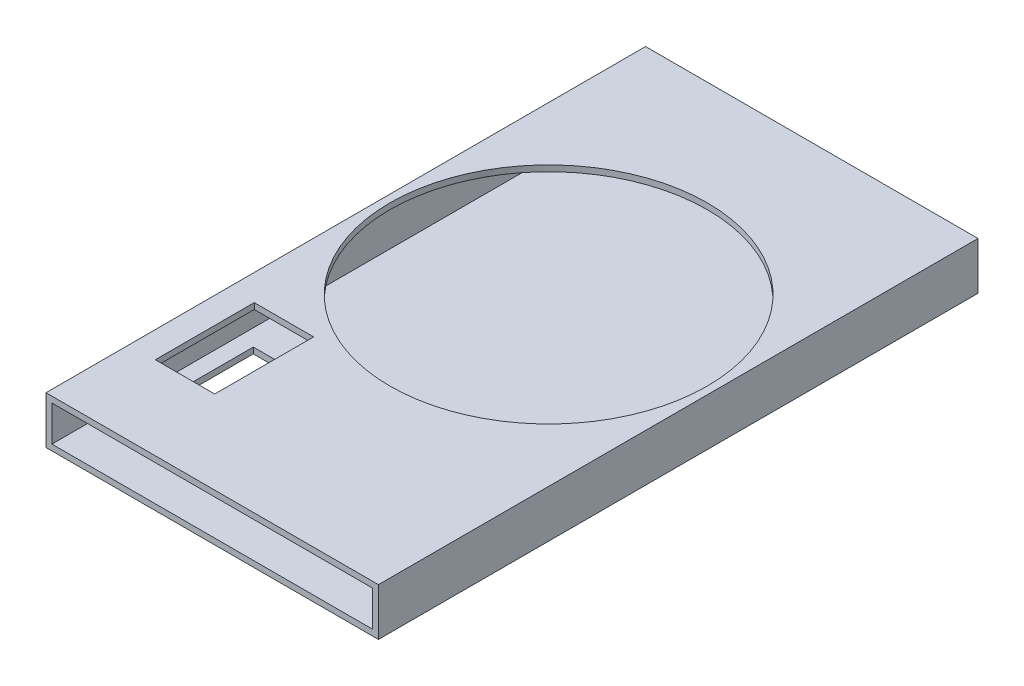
ISO-10303-21;
HEADER;
FILE_DESCRIPTION(('STEP AP214'),'2;1');
FILE_NAME('part.step','',(''),(''),'','','');
FILE_SCHEMA(('AUTOMOTIVE_DESIGN { 1 0 10303 214 1 1 1 1 }'));
ENDSEC;
DATA;
#1=APPLICATION_CONTEXT('core data for automotive mechanical design processes');
#2=APPLICATION_PROTOCOL_DEFINITION('international standard','automotive_design',2000,#1);
#3=PRODUCT_CONTEXT('',#1,'mechanical');
#4=PRODUCT('Part','Part','',(#3));
#5=PRODUCT_RELATED_PRODUCT_CATEGORY('part','',(#4));
#6=PRODUCT_DEFINITION_FORMATION('','',#4);
#7=PRODUCT_DEFINITION_CONTEXT('part definition',#1,'design');
#8=PRODUCT_DEFINITION('design','',#6,#7);
#9=PRODUCT_DEFINITION_SHAPE('','',#8);
#10=(LENGTH_UNIT() NAMED_UNIT(*) SI_UNIT(.MILLI.,.METRE.));
#11=(NAMED_UNIT(*) PLANE_ANGLE_UNIT() SI_UNIT($,.RADIAN.));
#12=(NAMED_UNIT(*) SI_UNIT($,.STERADIAN.) SOLID_ANGLE_UNIT());
#13=UNCERTAINTY_MEASURE_WITH_UNIT(LENGTH_MEASURE(1.E-05),#10,'distance_accuracy_value','');
#14=(GEOMETRIC_REPRESENTATION_CONTEXT(3) GLOBAL_UNCERTAINTY_ASSIGNED_CONTEXT((#13)) GLOBAL_UNIT_ASSIGNED_CONTEXT((#10,
#11,#12)) REPRESENTATION_CONTEXT('',''));
#15=CARTESIAN_POINT('',(0.,0.,0.));
#16=DIRECTION('',(0.,0.,1.));
#17=DIRECTION('',(1.,0.,0.));
#18=AXIS2_PLACEMENT_3D('',#15,#16,#17);
#19=CARTESIAN_POINT('',(-84.,-12.,300.));
#20=DIRECTION('',(0.,1.,0.));
#21=DIRECTION('',(0.,0.,1.));
#22=AXIS2_PLACEMENT_3D('',#19,#20,#21);
#23=PLANE('',#22);
#24=DIRECTION('',(0.,0.,-1.));
#25=VECTOR('',#24,1.);
#26=CARTESIAN_POINT('',(-84.,-12.,300.));
#27=LINE('',#26,#25);
#28=CARTESIAN_POINT('',(-84.,-12.,300.));
#29=VERTEX_POINT('',#28);
#30=CARTESIAN_POINT('',(-84.,-12.,-3.));
#31=VERTEX_POINT('',#30);
#32=EDGE_CURVE('E264',#29,#31,#27,.T.);
#33=ORIENTED_EDGE('',*,*,#32,.T.);
#34=DIRECTION('',(-1.,0.,0.));
#35=VECTOR('',#34,1.);
#36=CARTESIAN_POINT('',(84.,-12.,-3.));
#37=LINE('',#36,#35);
#38=CARTESIAN_POINT('',(84.,-12.,-3.));
#39=VERTEX_POINT('',#38);
#40=EDGE_CURVE('E217',#39,#31,#37,.T.);
#41=ORIENTED_EDGE('',*,*,#40,.F.);
#42=DIRECTION('',(0.,0.,-1.));
#43=VECTOR('',#42,1.);
#44=CARTESIAN_POINT('',(84.,-12.,300.));
#45=LINE('',#44,#43);
#46=CARTESIAN_POINT('',(84.,-12.,300.));
#47=VERTEX_POINT('',#46);
#48=EDGE_CURVE('E262',#47,#39,#45,.T.);
#49=ORIENTED_EDGE('',*,*,#48,.F.);
#50=DIRECTION('',(1.,0.,0.));
#51=VECTOR('',#50,1.);
#52=CARTESIAN_POINT('',(-84.,-12.,300.));
#53=LINE('',#52,#51);
#54=EDGE_CURVE('E260',#29,#47,#53,.T.);
#55=ORIENTED_EDGE('',*,*,#54,.F.);
#56=EDGE_LOOP('',(#33,#41,#49,#55));
#57=FACE_BOUND('',#56,.T.);
#58=DIRECTION('',(0.,0.,-1.));
#59=VECTOR('',#58,1.);
#60=CARTESIAN_POINT('',(-72.6000000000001,-12.,300.));
#61=LINE('',#60,#59);
#62=CARTESIAN_POINT('',(-72.6000000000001,-12.,272.652922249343));
#63=VERTEX_POINT('',#62);
#64=CARTESIAN_POINT('',(-72.6,-12.,206.652922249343));
#65=VERTEX_POINT('',#64);
#66=EDGE_CURVE('E203',#63,#65,#61,.T.);
#67=ORIENTED_EDGE('',*,*,#66,.F.);
#68=DIRECTION('',(-1.,0.,0.));
#69=VECTOR('',#68,1.);
#70=CARTESIAN_POINT('',(-84.,-12.,272.652922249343));
#71=LINE('',#70,#69);
#72=CARTESIAN_POINT('',(-39.,-12.,272.652922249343));
#73=VERTEX_POINT('',#72);
#74=EDGE_CURVE('E196',#73,#63,#71,.T.);
#75=ORIENTED_EDGE('',*,*,#74,.F.);
#76=DIRECTION('',(0.,0.,1.));
#77=VECTOR('',#76,1.);
#78=CARTESIAN_POINT('',(-39.,-12.,300.));
#79=LINE('',#78,#77);
#80=CARTESIAN_POINT('',(-39.,-12.,206.652922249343));
#81=VERTEX_POINT('',#80);
#82=EDGE_CURVE('E198',#81,#73,#79,.T.);
#83=ORIENTED_EDGE('',*,*,#82,.F.);
#84=DIRECTION('',(1.,0.,0.));
#85=VECTOR('',#84,1.);
#86=CARTESIAN_POINT('',(-84.,-12.,206.652922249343));
#87=LINE('',#86,#85);
#88=EDGE_CURVE('E201',#65,#81,#87,.T.);
#89=ORIENTED_EDGE('',*,*,#88,.F.);
#90=EDGE_LOOP('',(#67,#75,#83,#89));
#91=FACE_BOUND('',#90,.T.);
#92=ADVANCED_FACE('F45',(#57,#91),#23,.F.);
#93=CARTESIAN_POINT('',(81.,-9.,300.));
#94=DIRECTION('',(0.,1.,0.));
#95=DIRECTION('',(0.,0.,1.));
#96=AXIS2_PLACEMENT_3D('',#93,#94,#95);
#97=PLANE('',#96);
#98=DIRECTION('',(1.,0.,0.));
#99=VECTOR('',#98,1.);
#100=CARTESIAN_POINT('',(81.,-9.,0.));
#101=LINE('',#100,#99);
#102=CARTESIAN_POINT('',(-81.,-9.,0.));
#103=VERTEX_POINT('',#102);
#104=CARTESIAN_POINT('',(81.,-9.,0.));
#105=VERTEX_POINT('',#104);
#106=EDGE_CURVE('E237',#103,#105,#101,.T.);
#107=ORIENTED_EDGE('',*,*,#106,.F.);
#108=DIRECTION('',(0.,0.,-1.));
#109=VECTOR('',#108,1.);
#110=CARTESIAN_POINT('',(-81.,-9.,300.));
#111=LINE('',#110,#109);
#112=CARTESIAN_POINT('',(-81.,-9.,300.));
#113=VERTEX_POINT('',#112);
#114=EDGE_CURVE('E250',#113,#103,#111,.T.);
#115=ORIENTED_EDGE('',*,*,#114,.F.);
#116=DIRECTION('',(1.,0.,0.));
#117=VECTOR('',#116,1.);
#118=CARTESIAN_POINT('',(81.,-9.,300.));
#119=LINE('',#118,#117);
#120=CARTESIAN_POINT('',(81.,-9.,300.));
#121=VERTEX_POINT('',#120);
#122=EDGE_CURVE('E226',#113,#121,#119,.T.);
#123=ORIENTED_EDGE('',*,*,#122,.T.);
#124=DIRECTION('',(0.,0.,-1.));
#125=VECTOR('',#124,1.);
#126=CARTESIAN_POINT('',(81.,-9.,300.));
#127=LINE('',#126,#125);
#128=EDGE_CURVE('E248',#121,#105,#127,.T.);
#129=ORIENTED_EDGE('',*,*,#128,.T.);
#130=EDGE_LOOP('',(#107,#115,#123,#129));
#131=FACE_BOUND('',#130,.T.);
#132=DIRECTION('',(-1.,0.,0.));
#133=VECTOR('',#132,1.);
#134=CARTESIAN_POINT('',(81.,-9.,272.652922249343));
#135=LINE('',#134,#133);
#136=CARTESIAN_POINT('',(-39.,-9.,272.652922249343));
#137=VERTEX_POINT('',#136);
#138=CARTESIAN_POINT('',(-72.6000000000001,-9.,272.652922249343));
#139=VERTEX_POINT('',#138);
#140=EDGE_CURVE('E270',#137,#139,#135,.T.);
#141=ORIENTED_EDGE('',*,*,#140,.T.);
#142=DIRECTION('',(0.,0.,-1.));
#143=VECTOR('',#142,1.);
#144=CARTESIAN_POINT('',(-72.6000000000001,-9.,300.));
#145=LINE('',#144,#143);
#146=CARTESIAN_POINT('',(-72.6,-9.,206.652922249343));
#147=VERTEX_POINT('',#146);
#148=EDGE_CURVE('E279',#139,#147,#145,.T.);
#149=ORIENTED_EDGE('',*,*,#148,.T.);
#150=DIRECTION('',(1.,0.,0.));
#151=VECTOR('',#150,1.);
#152=CARTESIAN_POINT('',(81.,-9.,206.652922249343));
#153=LINE('',#152,#151);
#154=CARTESIAN_POINT('',(-39.,-9.,206.652922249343));
#155=VERTEX_POINT('',#154);
#156=EDGE_CURVE('E276',#147,#155,#153,.T.);
#157=ORIENTED_EDGE('',*,*,#156,.T.);
#158=DIRECTION('',(0.,0.,1.));
#159=VECTOR('',#158,1.);
#160=CARTESIAN_POINT('',(-39.,-9.,300.));
#161=LINE('',#160,#159);
#162=EDGE_CURVE('E273',#155,#137,#161,.T.);
#163=ORIENTED_EDGE('',*,*,#162,.T.);
#164=EDGE_LOOP('',(#141,#149,#157,#163));
#165=FACE_BOUND('',#164,.T.);
#166=ADVANCED_FACE('F307',(#131,#165),#97,.T.);
#167=CARTESIAN_POINT('',(0.,0.,300.));
#168=DIRECTION('',(0.,0.,1.));
#169=DIRECTION('',(1.,0.,0.));
#170=AXIS2_PLACEMENT_3D('',#167,#168,#169);
#171=PLANE('',#170);
#172=DIRECTION('',(0.,1.,0.));
#173=VECTOR('',#172,1.);
#174=CARTESIAN_POINT('',(84.,12.,300.));
#175=LINE('',#174,#173);
#176=CARTESIAN_POINT('',(84.,12.,300.));
#177=VERTEX_POINT('',#176);
#178=EDGE_CURVE('E253',#47,#177,#175,.T.);
#179=ORIENTED_EDGE('',*,*,#178,.T.);
#180=DIRECTION('',(-1.,0.,0.));
#181=VECTOR('',#180,1.);
#182=CARTESIAN_POINT('',(-84.,12.,300.));
#183=LINE('',#182,#181);
#184=CARTESIAN_POINT('',(-84.,12.,300.));
#185=VERTEX_POINT('',#184);
#186=EDGE_CURVE('E256',#177,#185,#183,.T.);
#187=ORIENTED_EDGE('',*,*,#186,.T.);
#188=DIRECTION('',(0.,-1.,0.));
#189=VECTOR('',#188,1.);
#190=CARTESIAN_POINT('',(-84.,12.,300.));
#191=LINE('',#190,#189);
#192=EDGE_CURVE('E258',#185,#29,#191,.T.);
#193=ORIENTED_EDGE('',*,*,#192,.T.);
#194=ORIENTED_EDGE('',*,*,#54,.T.);
#195=EDGE_LOOP('',(#179,#187,#193,#194));
#196=FACE_BOUND('',#195,.T.);
#197=ORIENTED_EDGE('',*,*,#122,.F.);
#198=DIRECTION('',(0.,-1.,0.));
#199=VECTOR('',#198,1.);
#200=CARTESIAN_POINT('',(-81.,-9.,300.));
#201=LINE('',#200,#199);
#202=CARTESIAN_POINT('',(-81.,9.,300.));
#203=VERTEX_POINT('',#202);
#204=EDGE_CURVE('E224',#203,#113,#201,.T.);
#205=ORIENTED_EDGE('',*,*,#204,.F.);
#206=DIRECTION('',(-1.,0.,0.));
#207=VECTOR('',#206,1.);
#208=CARTESIAN_POINT('',(81.,9.,300.));
#209=LINE('',#208,#207);
#210=CARTESIAN_POINT('',(81.,9.,300.));
#211=VERTEX_POINT('',#210);
#212=EDGE_CURVE('E232',#211,#203,#209,.T.);
#213=ORIENTED_EDGE('',*,*,#212,.F.);
#214=DIRECTION('',(0.,1.,0.));
#215=VECTOR('',#214,1.);
#216=CARTESIAN_POINT('',(81.,-9.,300.));
#217=LINE('',#216,#215);
#218=EDGE_CURVE('E229',#121,#211,#217,.T.);
#219=ORIENTED_EDGE('',*,*,#218,.F.);
#220=EDGE_LOOP('',(#197,#205,#213,#219));
#221=FACE_BOUND('',#220,.T.);
#222=ADVANCED_FACE('F314',(#196,#221),#171,.T.);
#223=CARTESIAN_POINT('',(84.,12.,300.));
#224=DIRECTION('',(-1.,0.,0.));
#225=DIRECTION('',(0.,0.,1.));
#226=AXIS2_PLACEMENT_3D('',#223,#224,#225);
#227=PLANE('',#226);
#228=ORIENTED_EDGE('',*,*,#48,.T.);
#229=DIRECTION('',(0.,-1.,0.));
#230=VECTOR('',#229,1.);
#231=CARTESIAN_POINT('',(84.,12.,-3.));
#232=LINE('',#231,#230);
#233=CARTESIAN_POINT('',(84.,12.,-3.));
#234=VERTEX_POINT('',#233);
#235=EDGE_CURVE('E214',#234,#39,#232,.T.);
#236=ORIENTED_EDGE('',*,*,#235,.F.);
#237=DIRECTION('',(0.,0.,-1.));
#238=VECTOR('',#237,1.);
#239=CARTESIAN_POINT('',(84.,12.,300.));
#240=LINE('',#239,#238);
#241=EDGE_CURVE('E268',#177,#234,#240,.T.);
#242=ORIENTED_EDGE('',*,*,#241,.F.);
#243=ORIENTED_EDGE('',*,*,#178,.F.);
#244=EDGE_LOOP('',(#228,#236,#242,#243));
#245=FACE_BOUND('',#244,.T.);
#246=ADVANCED_FACE('F47',(#245),#227,.F.);
#247=CARTESIAN_POINT('',(-84.,12.,300.));
#248=DIRECTION('',(0.,-1.,0.));
#249=DIRECTION('',(0.,0.,-1.));
#250=AXIS2_PLACEMENT_3D('',#247,#248,#249);
#251=PLANE('',#250);
#252=DIRECTION('',(-1.,0.,0.));
#253=VECTOR('',#252,1.);
#254=CARTESIAN_POINT('',(-70.8,12.,207.954991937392));
#255=LINE('',#254,#253);
#256=CARTESIAN_POINT('',(-40.8,12.,207.954991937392));
#257=VERTEX_POINT('',#256);
#258=CARTESIAN_POINT('',(-70.8,12.,207.954991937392));
#259=VERTEX_POINT('',#258);
#260=EDGE_CURVE('E169',#257,#259,#255,.T.);
#261=ORIENTED_EDGE('',*,*,#260,.F.);
#262=DIRECTION('',(0.,0.,-1.));
#263=VECTOR('',#262,1.);
#264=CARTESIAN_POINT('',(-40.8,12.,257.954991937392));
#265=LINE('',#264,#263);
#266=CARTESIAN_POINT('',(-40.8,12.,257.954991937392));
#267=VERTEX_POINT('',#266);
#268=EDGE_CURVE('E60',#267,#257,#265,.T.);
#269=ORIENTED_EDGE('',*,*,#268,.F.);
#270=DIRECTION('',(1.,0.,0.));
#271=VECTOR('',#270,1.);
#272=CARTESIAN_POINT('',(-70.8,12.,257.954991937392));
#273=LINE('',#272,#271);
#274=CARTESIAN_POINT('',(-70.8,12.,257.954991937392));
#275=VERTEX_POINT('',#274);
#276=EDGE_CURVE('E176',#275,#267,#273,.T.);
#277=ORIENTED_EDGE('',*,*,#276,.F.);
#278=DIRECTION('',(0.,0.,1.));
#279=VECTOR('',#278,1.);
#280=CARTESIAN_POINT('',(-70.8,12.,257.954991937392));
#281=LINE('',#280,#279);
#282=EDGE_CURVE('E160',#259,#275,#281,.T.);
#283=ORIENTED_EDGE('',*,*,#282,.F.);
#284=EDGE_LOOP('',(#261,#269,#277,#283));
#285=FACE_BOUND('',#284,.T.);
#286=CARTESIAN_POINT('',(0.,12.,130.));
#287=DIRECTION('',(0.,1.,0.));
#288=DIRECTION('',(0.,0.,1.));
#289=AXIS2_PLACEMENT_3D('',#286,#287,#288);
#290=CIRCLE('',#289,80.2);
#291=CARTESIAN_POINT('',(0.,12.,210.2));
#292=VERTEX_POINT('',#291);
#293=EDGE_CURVE('E205',#292,#292,#290,.T.);
#294=ORIENTED_EDGE('',*,*,#293,.F.);
#295=EDGE_LOOP('',(#294));
#296=FACE_BOUND('',#295,.T.);
#297=ORIENTED_EDGE('',*,*,#241,.T.);
#298=DIRECTION('',(1.,0.,0.));
#299=VECTOR('',#298,1.);
#300=CARTESIAN_POINT('',(-84.,12.,-3.));
#301=LINE('',#300,#299);
#302=CARTESIAN_POINT('',(-84.,12.,-3.));
#303=VERTEX_POINT('',#302);
#304=EDGE_CURVE('E209',#303,#234,#301,.T.);
#305=ORIENTED_EDGE('',*,*,#304,.F.);
#306=DIRECTION('',(0.,0.,-1.));
#307=VECTOR('',#306,1.);
#308=CARTESIAN_POINT('',(-84.,12.,300.));
#309=LINE('',#308,#307);
#310=EDGE_CURVE('E266',#185,#303,#309,.T.);
#311=ORIENTED_EDGE('',*,*,#310,.F.);
#312=ORIENTED_EDGE('',*,*,#186,.F.);
#313=EDGE_LOOP('',(#297,#305,#311,#312));
#314=FACE_BOUND('',#313,.T.);
#315=ADVANCED_FACE('F173',(#285,#296,#314),#251,.F.);
#316=CARTESIAN_POINT('',(-84.,12.,300.));
#317=DIRECTION('',(1.,0.,0.));
#318=DIRECTION('',(0.,0.,-1.));
#319=AXIS2_PLACEMENT_3D('',#316,#317,#318);
#320=PLANE('',#319);
#321=ORIENTED_EDGE('',*,*,#310,.T.);
#322=DIRECTION('',(0.,1.,0.));
#323=VECTOR('',#322,1.);
#324=CARTESIAN_POINT('',(-84.,-12.,-3.));
#325=LINE('',#324,#323);
#326=EDGE_CURVE('E220',#31,#303,#325,.T.);
#327=ORIENTED_EDGE('',*,*,#326,.F.);
#328=ORIENTED_EDGE('',*,*,#32,.F.);
#329=ORIENTED_EDGE('',*,*,#192,.F.);
#330=EDGE_LOOP('',(#321,#327,#328,#329));
#331=FACE_BOUND('',#330,.T.);
#332=ADVANCED_FACE('F321',(#331),#320,.F.);
#333=CARTESIAN_POINT('',(-81.,-9.,300.));
#334=DIRECTION('',(1.,0.,0.));
#335=DIRECTION('',(0.,0.,-1.));
#336=AXIS2_PLACEMENT_3D('',#333,#334,#335);
#337=PLANE('',#336);
#338=DIRECTION('',(0.,-1.,0.));
#339=VECTOR('',#338,1.);
#340=CARTESIAN_POINT('',(-81.,-9.,0.));
#341=LINE('',#340,#339);
#342=CARTESIAN_POINT('',(-81.,9.,0.));
#343=VERTEX_POINT('',#342);
#344=EDGE_CURVE('E223',#343,#103,#341,.T.);
#345=ORIENTED_EDGE('',*,*,#344,.F.);
#346=DIRECTION('',(0.,0.,-1.));
#347=VECTOR('',#346,1.);
#348=CARTESIAN_POINT('',(-81.,9.,300.));
#349=LINE('',#348,#347);
#350=EDGE_CURVE('E234',#203,#343,#349,.T.);
#351=ORIENTED_EDGE('',*,*,#350,.F.);
#352=ORIENTED_EDGE('',*,*,#204,.T.);
#353=ORIENTED_EDGE('',*,*,#114,.T.);
#354=EDGE_LOOP('',(#345,#351,#352,#353));
#355=FACE_BOUND('',#354,.T.);
#356=ADVANCED_FACE('F323',(#355),#337,.T.);
#357=CARTESIAN_POINT('',(81.,-9.,300.));
#358=DIRECTION('',(-1.,0.,0.));
#359=DIRECTION('',(0.,0.,1.));
#360=AXIS2_PLACEMENT_3D('',#357,#358,#359);
#361=PLANE('',#360);
#362=DIRECTION('',(0.,1.,0.));
#363=VECTOR('',#362,1.);
#364=CARTESIAN_POINT('',(81.,-9.,0.));
#365=LINE('',#364,#363);
#366=CARTESIAN_POINT('',(81.,9.,0.));
#367=VERTEX_POINT('',#366);
#368=EDGE_CURVE('E240',#105,#367,#365,.T.);
#369=ORIENTED_EDGE('',*,*,#368,.F.);
#370=ORIENTED_EDGE('',*,*,#128,.F.);
#371=ORIENTED_EDGE('',*,*,#218,.T.);
#372=DIRECTION('',(0.,0.,-1.));
#373=VECTOR('',#372,1.);
#374=CARTESIAN_POINT('',(81.,9.,300.));
#375=LINE('',#374,#373);
#376=EDGE_CURVE('E246',#211,#367,#375,.T.);
#377=ORIENTED_EDGE('',*,*,#376,.T.);
#378=EDGE_LOOP('',(#369,#370,#371,#377));
#379=FACE_BOUND('',#378,.T.);
#380=ADVANCED_FACE('F358',(#379),#361,.T.);
#381=CARTESIAN_POINT('',(81.,9.,300.));
#382=DIRECTION('',(0.,-1.,0.));
#383=DIRECTION('',(0.,0.,-1.));
#384=AXIS2_PLACEMENT_3D('',#381,#382,#383);
#385=PLANE('',#384);
#386=DIRECTION('',(0.,0.,1.));
#387=VECTOR('',#386,1.);
#388=CARTESIAN_POINT('',(-40.8,9.,300.));
#389=LINE('',#388,#387);
#390=CARTESIAN_POINT('',(-40.8,9.,207.954991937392));
#391=VERTEX_POINT('',#390);
#392=CARTESIAN_POINT('',(-40.8,9.,257.954991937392));
#393=VERTEX_POINT('',#392);
#394=EDGE_CURVE('E11',#391,#393,#389,.T.);
#395=ORIENTED_EDGE('',*,*,#394,.F.);
#396=DIRECTION('',(1.,0.,0.));
#397=VECTOR('',#396,1.);
#398=CARTESIAN_POINT('',(81.,9.,207.954991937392));
#399=LINE('',#398,#397);
#400=CARTESIAN_POINT('',(-70.8,9.,207.954991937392));
#401=VERTEX_POINT('',#400);
#402=EDGE_CURVE('E282',#401,#391,#399,.T.);
#403=ORIENTED_EDGE('',*,*,#402,.F.);
#404=DIRECTION('',(0.,0.,-1.));
#405=VECTOR('',#404,1.);
#406=CARTESIAN_POINT('',(-70.8,9.,300.));
#407=LINE('',#406,#405);
#408=CARTESIAN_POINT('',(-70.8,9.,257.954991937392));
#409=VERTEX_POINT('',#408);
#410=EDGE_CURVE('E163',#409,#401,#407,.T.);
#411=ORIENTED_EDGE('',*,*,#410,.F.);
#412=DIRECTION('',(-1.,0.,0.));
#413=VECTOR('',#412,1.);
#414=CARTESIAN_POINT('',(81.,9.,257.954991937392));
#415=LINE('',#414,#413);
#416=EDGE_CURVE('E53',#393,#409,#415,.T.);
#417=ORIENTED_EDGE('',*,*,#416,.F.);
#418=EDGE_LOOP('',(#395,#403,#411,#417));
#419=FACE_BOUND('',#418,.T.);
#420=CARTESIAN_POINT('',(0.,9.,130.));
#421=DIRECTION('',(0.,1.,0.));
#422=DIRECTION('',(0.,0.,1.));
#423=AXIS2_PLACEMENT_3D('',#420,#421,#422);
#424=CIRCLE('',#423,80.2);
#425=CARTESIAN_POINT('',(0.,9.,210.2));
#426=VERTEX_POINT('',#425);
#427=EDGE_CURVE('E206',#426,#426,#424,.T.);
#428=ORIENTED_EDGE('',*,*,#427,.T.);
#429=EDGE_LOOP('',(#428));
#430=FACE_BOUND('',#429,.T.);
#431=DIRECTION('',(-1.,0.,0.));
#432=VECTOR('',#431,1.);
#433=CARTESIAN_POINT('',(81.,9.,0.));
#434=LINE('',#433,#432);
#435=EDGE_CURVE('E227',#367,#343,#434,.T.);
#436=ORIENTED_EDGE('',*,*,#435,.F.);
#437=ORIENTED_EDGE('',*,*,#376,.F.);
#438=ORIENTED_EDGE('',*,*,#212,.T.);
#439=ORIENTED_EDGE('',*,*,#350,.T.);
#440=EDGE_LOOP('',(#436,#437,#438,#439));
#441=FACE_BOUND('',#440,.T.);
#442=ADVANCED_FACE('F290',(#419,#430,#441),#385,.T.);
#443=CARTESIAN_POINT('',(0.,0.,0.));
#444=DIRECTION('',(0.,0.,-1.));
#445=DIRECTION('',(-1.,0.,0.));
#446=AXIS2_PLACEMENT_3D('',#443,#444,#445);
#447=PLANE('',#446);
#448=ORIENTED_EDGE('',*,*,#435,.T.);
#449=ORIENTED_EDGE('',*,*,#344,.T.);
#450=ORIENTED_EDGE('',*,*,#106,.T.);
#451=ORIENTED_EDGE('',*,*,#368,.T.);
#452=EDGE_LOOP('',(#448,#449,#450,#451));
#453=FACE_BOUND('',#452,.T.);
#454=ADVANCED_FACE('F361',(#453),#447,.F.);
#455=CARTESIAN_POINT('',(0.,0.,-3.));
#456=DIRECTION('',(0.,0.,-1.));
#457=DIRECTION('',(-1.,0.,0.));
#458=AXIS2_PLACEMENT_3D('',#455,#456,#457);
#459=PLANE('',#458);
#460=ORIENTED_EDGE('',*,*,#304,.T.);
#461=ORIENTED_EDGE('',*,*,#235,.T.);
#462=ORIENTED_EDGE('',*,*,#40,.T.);
#463=ORIENTED_EDGE('',*,*,#326,.T.);
#464=EDGE_LOOP('',(#460,#461,#462,#463));
#465=FACE_BOUND('',#464,.T.);
#466=ADVANCED_FACE('F341',(#465),#459,.T.);
#467=CARTESIAN_POINT('',(0.,9.,130.));
#468=DIRECTION('',(0.,1.,0.));
#469=DIRECTION('',(0.,0.,1.));
#470=AXIS2_PLACEMENT_3D('',#467,#468,#469);
#471=CYLINDRICAL_SURFACE('',#470,80.2);
#472=ORIENTED_EDGE('',*,*,#427,.F.);
#473=EDGE_LOOP('',(#472));
#474=FACE_BOUND('',#473,.T.);
#475=ORIENTED_EDGE('',*,*,#293,.T.);
#476=EDGE_LOOP('',(#475));
#477=FACE_BOUND('',#476,.T.);
#478=ADVANCED_FACE('F396',(#474,#477),#471,.F.);
#479=CARTESIAN_POINT('',(-72.6000000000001,-12.000012,272.652922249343));
#480=DIRECTION('',(1.,0.,0.));
#481=DIRECTION('',(0.,0.,-1.));
#482=AXIS2_PLACEMENT_3D('',#479,#480,#481);
#483=PLANE('',#482);
#484=ORIENTED_EDGE('',*,*,#66,.T.);
#485=DIRECTION('',(0.,1.,0.));
#486=VECTOR('',#485,1.);
#487=CARTESIAN_POINT('',(-72.6,-12.000012,206.652922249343));
#488=LINE('',#487,#486);
#489=EDGE_CURVE('E193',#65,#147,#488,.T.);
#490=ORIENTED_EDGE('',*,*,#489,.T.);
#491=ORIENTED_EDGE('',*,*,#148,.F.);
#492=DIRECTION('',(0.,1.,0.));
#493=VECTOR('',#492,1.);
#494=CARTESIAN_POINT('',(-72.6000000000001,-12.000012,272.652922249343));
#495=LINE('',#494,#493);
#496=EDGE_CURVE('E183',#63,#139,#495,.T.);
#497=ORIENTED_EDGE('',*,*,#496,.F.);
#498=EDGE_LOOP('',(#484,#490,#491,#497));
#499=FACE_BOUND('',#498,.T.);
#500=ADVANCED_FACE('F402',(#499),#483,.T.);
#501=CARTESIAN_POINT('',(-72.6,-12.000012,206.652922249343));
#502=DIRECTION('',(0.,0.,1.));
#503=DIRECTION('',(1.,0.,0.));
#504=AXIS2_PLACEMENT_3D('',#501,#502,#503);
#505=PLANE('',#504);
#506=ORIENTED_EDGE('',*,*,#88,.T.);
#507=DIRECTION('',(0.,1.,0.));
#508=VECTOR('',#507,1.);
#509=CARTESIAN_POINT('',(-39.,-12.000012,206.652922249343));
#510=LINE('',#509,#508);
#511=EDGE_CURVE('E190',#81,#155,#510,.T.);
#512=ORIENTED_EDGE('',*,*,#511,.T.);
#513=ORIENTED_EDGE('',*,*,#156,.F.);
#514=ORIENTED_EDGE('',*,*,#489,.F.);
#515=EDGE_LOOP('',(#506,#512,#513,#514));
#516=FACE_BOUND('',#515,.T.);
#517=ADVANCED_FACE('F427',(#516),#505,.T.);
#518=CARTESIAN_POINT('',(-39.,-12.000012,272.652922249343));
#519=DIRECTION('',(-1.,0.,0.));
#520=DIRECTION('',(0.,0.,1.));
#521=AXIS2_PLACEMENT_3D('',#518,#519,#520);
#522=PLANE('',#521);
#523=ORIENTED_EDGE('',*,*,#82,.T.);
#524=DIRECTION('',(0.,1.,0.));
#525=VECTOR('',#524,1.);
#526=CARTESIAN_POINT('',(-39.,-12.000012,272.652922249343));
#527=LINE('',#526,#525);
#528=EDGE_CURVE('E187',#73,#137,#527,.T.);
#529=ORIENTED_EDGE('',*,*,#528,.T.);
#530=ORIENTED_EDGE('',*,*,#162,.F.);
#531=ORIENTED_EDGE('',*,*,#511,.F.);
#532=EDGE_LOOP('',(#523,#529,#530,#531));
#533=FACE_BOUND('',#532,.T.);
#534=ADVANCED_FACE('F302',(#533),#522,.T.);
#535=CARTESIAN_POINT('',(-72.6000000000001,-12.000012,272.652922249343));
#536=DIRECTION('',(0.,0.,-1.));
#537=DIRECTION('',(-1.,0.,0.));
#538=AXIS2_PLACEMENT_3D('',#535,#536,#537);
#539=PLANE('',#538);
#540=ORIENTED_EDGE('',*,*,#74,.T.);
#541=ORIENTED_EDGE('',*,*,#496,.T.);
#542=ORIENTED_EDGE('',*,*,#140,.F.);
#543=ORIENTED_EDGE('',*,*,#528,.F.);
#544=EDGE_LOOP('',(#540,#541,#542,#543));
#545=FACE_BOUND('',#544,.T.);
#546=ADVANCED_FACE('F294',(#545),#539,.T.);
#547=CARTESIAN_POINT('',(-40.8,7.,257.954991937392));
#548=DIRECTION('',(1.,0.,0.));
#549=DIRECTION('',(0.,0.,-1.));
#550=AXIS2_PLACEMENT_3D('',#547,#548,#549);
#551=PLANE('',#550);
#552=ORIENTED_EDGE('',*,*,#394,.T.);
#553=DIRECTION('',(0.,1.,0.));
#554=VECTOR('',#553,1.);
#555=CARTESIAN_POINT('',(-40.8,7.,257.954991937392));
#556=LINE('',#555,#554);
#557=EDGE_CURVE('E181',#393,#267,#556,.T.);
#558=ORIENTED_EDGE('',*,*,#557,.T.);
#559=ORIENTED_EDGE('',*,*,#268,.T.);
#560=DIRECTION('',(0.,1.,0.));
#561=VECTOR('',#560,1.);
#562=CARTESIAN_POINT('',(-40.8,7.,207.954991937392));
#563=LINE('',#562,#561);
#564=EDGE_CURVE('E166',#391,#257,#563,.T.);
#565=ORIENTED_EDGE('',*,*,#564,.F.);
#566=EDGE_LOOP('',(#552,#558,#559,#565));
#567=FACE_BOUND('',#566,.T.);
#568=ADVANCED_FACE('F292',(#567),#551,.F.);
#569=CARTESIAN_POINT('',(-70.8,7.,257.954991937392));
#570=DIRECTION('',(0.,0.,1.));
#571=DIRECTION('',(1.,0.,0.));
#572=AXIS2_PLACEMENT_3D('',#569,#570,#571);
#573=PLANE('',#572);
#574=ORIENTED_EDGE('',*,*,#416,.T.);
#575=DIRECTION('',(0.,1.,0.));
#576=VECTOR('',#575,1.);
#577=CARTESIAN_POINT('',(-70.8,7.,257.954991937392));
#578=LINE('',#577,#576);
#579=EDGE_CURVE('E165',#409,#275,#578,.T.);
#580=ORIENTED_EDGE('',*,*,#579,.T.);
#581=ORIENTED_EDGE('',*,*,#276,.T.);
#582=ORIENTED_EDGE('',*,*,#557,.F.);
#583=EDGE_LOOP('',(#574,#580,#581,#582));
#584=FACE_BOUND('',#583,.T.);
#585=ADVANCED_FACE('F287',(#584),#573,.F.);
#586=CARTESIAN_POINT('',(-70.8,7.,257.954991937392));
#587=DIRECTION('',(-1.,0.,0.));
#588=DIRECTION('',(0.,0.,1.));
#589=AXIS2_PLACEMENT_3D('',#586,#587,#588);
#590=PLANE('',#589);
#591=ORIENTED_EDGE('',*,*,#410,.T.);
#592=DIRECTION('',(0.,1.,0.));
#593=VECTOR('',#592,1.);
#594=CARTESIAN_POINT('',(-70.8,7.,207.954991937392));
#595=LINE('',#594,#593);
#596=EDGE_CURVE('E68',#401,#259,#595,.T.);
#597=ORIENTED_EDGE('',*,*,#596,.T.);
#598=ORIENTED_EDGE('',*,*,#282,.T.);
#599=ORIENTED_EDGE('',*,*,#579,.F.);
#600=EDGE_LOOP('',(#591,#597,#598,#599));
#601=FACE_BOUND('',#600,.T.);
#602=ADVANCED_FACE('F157',(#601),#590,.F.);
#603=CARTESIAN_POINT('',(-70.8,7.,207.954991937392));
#604=DIRECTION('',(0.,0.,-1.));
#605=DIRECTION('',(-1.,0.,0.));
#606=AXIS2_PLACEMENT_3D('',#603,#604,#605);
#607=PLANE('',#606);
#608=ORIENTED_EDGE('',*,*,#402,.T.);
#609=ORIENTED_EDGE('',*,*,#564,.T.);
#610=ORIENTED_EDGE('',*,*,#260,.T.);
#611=ORIENTED_EDGE('',*,*,#596,.F.);
#612=EDGE_LOOP('',(#608,#609,#610,#611));
#613=FACE_BOUND('',#612,.T.);
#614=ADVANCED_FACE('F170',(#613),#607,.F.);
#615=CLOSED_SHELL('',(#92,#166,#222,#246,#315,#332,#356,#380,#442,#454,#466,#478,#500,#517,#534,
#546,#568,#585,#602,#614));
#616=MANIFOLD_SOLID_BREP('B2',#615);
#617=ADVANCED_BREP_SHAPE_REPRESENTATION('',(#18,#616),#14);
#618=SHAPE_DEFINITION_REPRESENTATION(#9,#617);
ENDSEC;
END-ISO-10303-21;
